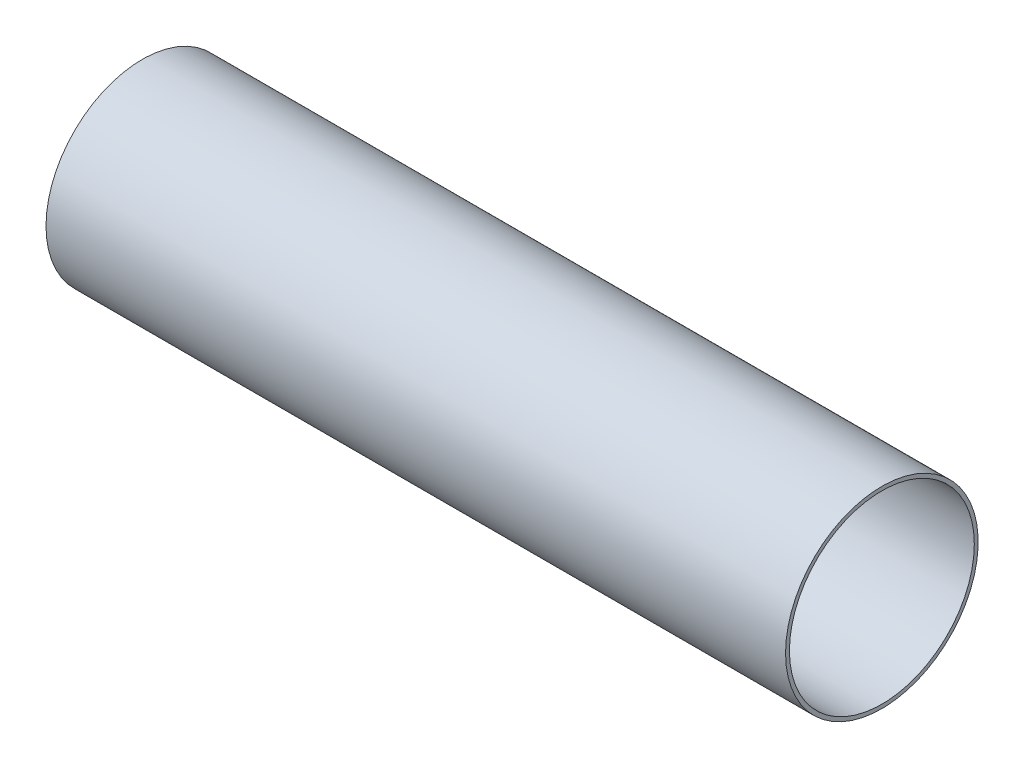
from build123d import *

# Parameters (mm, degrees)
SKETCH1_R      = 39.6875
SKETCH1_R_2    = 38.1
EXTRUDE1_DEPTH = 304.8


with BuildPart() as part:
    # Sketch1 → Extrude1 (new body)
    with BuildSketch(Plane(origin=(0, 0, 0), x_dir=(0, 0, -1), z_dir=(1, 0, 0))):
        with Locations(Location((0, 0, 0), (0, 0, 180))):
            Circle(SKETCH1_R)
        with Locations(Location((0, 0, 0), (0, 0, 180))):
            Circle(SKETCH1_R_2, mode=Mode.SUBTRACT)
    extrude(amount=EXTRUDE1_DEPTH)


solid = part.part
